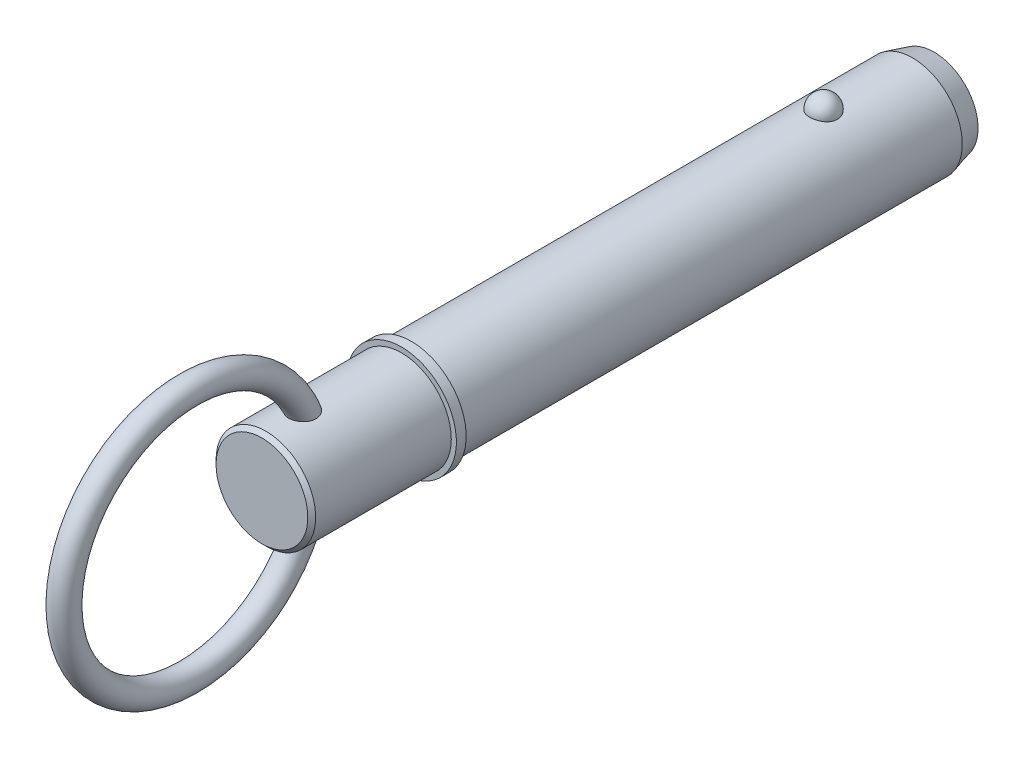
ISO-10303-21;
HEADER;
FILE_DESCRIPTION(('STEP AP214'),'2;1');
FILE_NAME('part.step','',(''),(''),'','','');
FILE_SCHEMA(('AUTOMOTIVE_DESIGN { 1 0 10303 214 1 1 1 1 }'));
ENDSEC;
DATA;
#1=APPLICATION_CONTEXT('core data for automotive mechanical design processes');
#2=APPLICATION_PROTOCOL_DEFINITION('international standard','automotive_design',2000,#1);
#3=PRODUCT_CONTEXT('',#1,'mechanical');
#4=PRODUCT('Part','Part','',(#3));
#5=PRODUCT_RELATED_PRODUCT_CATEGORY('part','',(#4));
#6=PRODUCT_DEFINITION_FORMATION('','',#4);
#7=PRODUCT_DEFINITION_CONTEXT('part definition',#1,'design');
#8=PRODUCT_DEFINITION('design','',#6,#7);
#9=PRODUCT_DEFINITION_SHAPE('','',#8);
#10=(LENGTH_UNIT() NAMED_UNIT(*) SI_UNIT(.MILLI.,.METRE.));
#11=(NAMED_UNIT(*) PLANE_ANGLE_UNIT() SI_UNIT($,.RADIAN.));
#12=(NAMED_UNIT(*) SI_UNIT($,.STERADIAN.) SOLID_ANGLE_UNIT());
#13=UNCERTAINTY_MEASURE_WITH_UNIT(LENGTH_MEASURE(1.E-05),#10,'distance_accuracy_value','');
#14=(GEOMETRIC_REPRESENTATION_CONTEXT(3) GLOBAL_UNCERTAINTY_ASSIGNED_CONTEXT((#13)) GLOBAL_UNIT_ASSIGNED_CONTEXT((#10,
#11,#12)) REPRESENTATION_CONTEXT('',''));
#15=CARTESIAN_POINT('',(0.,0.,0.));
#16=DIRECTION('',(0.,0.,1.));
#17=DIRECTION('',(1.,0.,0.));
#18=AXIS2_PLACEMENT_3D('',#15,#16,#17);
#19=CARTESIAN_POINT('',(0.,0.,101.6));
#20=DIRECTION('',(0.,0.,-1.));
#21=DIRECTION('',(-1.,0.,0.));
#22=AXIS2_PLACEMENT_3D('',#19,#20,#21);
#23=CYLINDRICAL_SURFACE('',#22,12.7);
#24=CARTESIAN_POINT('',(3.52486003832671,12.2010393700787,-3.56));
#25=CARTESIAN_POINT('',(3.52485671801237,12.2010422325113,-3.3610062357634));
#26=CARTESIAN_POINT('',(3.50863187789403,12.2057632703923,-3.16197042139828));
#27=CARTESIAN_POINT('',(3.4441205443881,12.2241207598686,-2.76953945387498));
#28=CARTESIAN_POINT('',(3.39582213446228,12.2377605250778,-2.57614642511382));
#29=CARTESIAN_POINT('',(3.26839193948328,12.2724057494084,-2.20059799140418));
#30=CARTESIAN_POINT('',(3.18927369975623,12.2934079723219,-2.01843769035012));
#31=CARTESIAN_POINT('',(3.00217139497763,12.3404306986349,-1.6703228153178));
#32=CARTESIAN_POINT('',(2.89418796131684,12.3664510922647,-1.50436788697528));
#33=CARTESIAN_POINT('',(2.65144862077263,12.4207616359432,-1.19241975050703));
#34=CARTESIAN_POINT('',(2.51656310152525,12.4490623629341,-1.04652919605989));
#35=CARTESIAN_POINT('',(2.22383249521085,12.5046678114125,-0.779711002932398));
#36=CARTESIAN_POINT('',(2.0659873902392,12.5319725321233,-0.658783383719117));
#37=CARTESIAN_POINT('',(1.73204520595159,12.5824645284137,-0.445586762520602));
#38=CARTESIAN_POINT('',(1.55600183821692,12.6056634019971,-0.353236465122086));
#39=CARTESIAN_POINT('',(1.19021695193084,12.6454411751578,-0.199381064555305));
#40=CARTESIAN_POINT('',(1.00047694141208,12.6620208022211,-0.137872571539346));
#41=CARTESIAN_POINT('',(0.616329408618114,12.6864692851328,-0.0483191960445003));
#42=CARTESIAN_POINT('',(0.422067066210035,12.6944893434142,-0.0196927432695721));
#43=CARTESIAN_POINT('',(0.0313259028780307,12.7014637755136,0.00524116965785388));
#44=CARTESIAN_POINT('',(-0.165152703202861,12.7004190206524,0.00155173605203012));
#45=CARTESIAN_POINT('',(-0.551780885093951,12.6894611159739,-0.0377454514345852));
#46=CARTESIAN_POINT('',(-0.74198078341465,12.6796749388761,-0.0728962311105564));
#47=CARTESIAN_POINT('',(-1.11361063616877,12.6524544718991,-0.173489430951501));
#48=CARTESIAN_POINT('',(-1.29504043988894,12.6350200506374,-0.238932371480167));
#49=CARTESIAN_POINT('',(-1.64521311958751,12.5942270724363,-0.398772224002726));
#50=CARTESIAN_POINT('',(-1.81387645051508,12.5708347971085,-0.493334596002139));
#51=CARTESIAN_POINT('',(-2.13292959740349,12.5206522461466,-0.708731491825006));
#52=CARTESIAN_POINT('',(-2.28331755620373,12.4938616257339,-0.829568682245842));
#53=CARTESIAN_POINT('',(-2.56470285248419,12.4391828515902,-1.0968714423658));
#54=CARTESIAN_POINT('',(-2.69527522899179,12.4112835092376,-1.24378221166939));
#55=CARTESIAN_POINT('',(-2.93023079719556,12.3579248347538,-1.55763192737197));
#56=CARTESIAN_POINT('',(-3.03461212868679,12.3324656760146,-1.72457229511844));
#57=CARTESIAN_POINT('',(-3.21564423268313,12.2865167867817,-2.07598316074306));
#58=CARTESIAN_POINT('',(-3.29196222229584,12.2660875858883,-2.26063321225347));
#59=CARTESIAN_POINT('',(-3.41323771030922,12.2328979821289,-2.64061334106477));
#60=CARTESIAN_POINT('',(-3.45819611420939,12.2201373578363,-2.83594310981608));
#61=CARTESIAN_POINT('',(-3.51550038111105,12.2037762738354,-3.2308649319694));
#62=CARTESIAN_POINT('',(-3.5279827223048,12.200137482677,-3.43043558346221));
#63=CARTESIAN_POINT('',(-3.52041430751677,12.2023234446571,-3.8289025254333));
#64=CARTESIAN_POINT('',(-3.50036443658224,12.2081479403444,-4.02779883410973));
#65=CARTESIAN_POINT('',(-3.42842010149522,12.2285446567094,-4.41824213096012));
#66=CARTESIAN_POINT('',(-3.37668525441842,12.243073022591,-4.6098208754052));
#67=CARTESIAN_POINT('',(-3.24279085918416,12.2792134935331,-4.98132360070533));
#68=CARTESIAN_POINT('',(-3.16063009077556,12.300825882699,-5.16124711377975));
#69=CARTESIAN_POINT('',(-2.96738224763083,12.3488691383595,-5.50542856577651));
#70=CARTESIAN_POINT('',(-2.85613997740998,12.3753256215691,-5.66959579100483));
#71=CARTESIAN_POINT('',(-2.60773241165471,12.4300386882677,-5.97665065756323));
#72=CARTESIAN_POINT('',(-2.47056612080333,12.458295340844,-6.11953748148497));
#73=CARTESIAN_POINT('',(-2.17327999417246,12.5135827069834,-6.38059312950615));
#74=CARTESIAN_POINT('',(-2.01307652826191,12.5406084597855,-6.49866785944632));
#75=CARTESIAN_POINT('',(-1.67442544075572,12.5902954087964,-6.70609314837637));
#76=CARTESIAN_POINT('',(-1.49597909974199,12.6129569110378,-6.79544572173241));
#77=CARTESIAN_POINT('',(-1.12819666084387,12.6511224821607,-6.94192787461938));
#78=CARTESIAN_POINT('',(-0.93902400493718,12.666712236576,-6.99944518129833));
#79=CARTESIAN_POINT('',(-0.553267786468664,12.6894125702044,-7.08227444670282));
#80=CARTESIAN_POINT('',(-0.356685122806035,12.6965241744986,-7.10759029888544));
#81=CARTESIAN_POINT('',(0.0343320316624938,12.7014305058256,-7.12510946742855));
#82=CARTESIAN_POINT('',(0.228736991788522,12.6993986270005,-7.11792901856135));
#83=CARTESIAN_POINT('',(0.613493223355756,12.6866339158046,-7.07206766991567));
#84=CARTESIAN_POINT('',(0.803844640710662,12.6759013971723,-7.03338790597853));
#85=CARTESIAN_POINT('',(1.17440741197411,12.6469443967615,-6.925834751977));
#86=CARTESIAN_POINT('',(1.35465462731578,12.6287486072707,-6.85707692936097));
#87=CARTESIAN_POINT('',(1.70092526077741,12.5867908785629,-6.69128257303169));
#88=CARTESIAN_POINT('',(1.86694777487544,12.5630285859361,-6.59424424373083));
#89=CARTESIAN_POINT('',(2.18289085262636,12.5120350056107,-6.3727748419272));
#90=CARTESIAN_POINT('',(2.33252391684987,12.4847559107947,-6.24794475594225));
#91=CARTESIAN_POINT('',(2.60889724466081,12.4299457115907,-5.97511730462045));
#92=CARTESIAN_POINT('',(2.73563353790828,12.4024145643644,-5.82711592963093));
#93=CARTESIAN_POINT('',(2.96505559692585,12.3495984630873,-5.5091226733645));
#94=CARTESIAN_POINT('',(3.06728335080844,12.3243610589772,-5.33879227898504));
#95=CARTESIAN_POINT('',(3.24218794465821,12.2795120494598,-4.98295005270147));
#96=CARTESIAN_POINT('',(3.31487538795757,12.2598984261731,-4.79744369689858));
#97=CARTESIAN_POINT('',(3.42255689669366,12.2302435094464,-4.43775244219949));
#98=CARTESIAN_POINT('',(3.46085292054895,12.2193780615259,-4.264615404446));
#99=CARTESIAN_POINT('',(3.5120056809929,12.2047747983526,-3.9143299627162));
#100=CARTESIAN_POINT('',(3.52486299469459,12.2010368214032,-3.73718164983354));
#101=CARTESIAN_POINT('',(3.52486003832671,12.2010393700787,-3.56));
#102=B_SPLINE_CURVE_WITH_KNOTS('',3,(#24,#25,#26,#27,#28,#29,#30,#31,#32,#33,#34,#35,#36,#37,
#38,#39,#40,#41,#42,#43,#44,#45,#46,#47,#48,#49,#50,#51,#52,#53,#54,#55,#56,#57,#58,#59,#60,#61,
#62,#63,#64,#65,#66,#67,#68,#69,#70,#71,#72,#73,#74,#75,#76,#77,#78,#79,#80,#81,#82,#83,#84,#85,
#86,#87,#88,#89,#90,#91,#92,#93,#94,#95,#96,#97,#98,#99,#100,#101),.UNSPECIFIED.,.T.,.F.,(4,2,2,
2,2,2,2,2,2,2,2,2,2,2,2,2,2,2,2,2,2,2,2,2,2,2,2,2,2,2,2,2,2,2,2,2,2,2,4),(0.,0.596344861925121,
1.19291141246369,1.78921606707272,2.38550767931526,2.98474477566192,3.58398233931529,
4.18149920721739,4.77895038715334,5.36566361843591,5.95232045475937,6.53059198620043,
7.10887345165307,7.6905033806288,8.27219236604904,8.86498552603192,9.45782077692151,
10.0574751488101,10.6571122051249,11.2542252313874,11.8513220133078,12.4454353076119,
13.0395724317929,13.636947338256,14.2343451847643,14.8339691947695,15.4335511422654,
16.0256602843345,16.6176978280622,17.1985559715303,17.7793931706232,18.3580179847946,
18.9366795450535,19.5242567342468,20.1119357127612,20.7098642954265,21.3075780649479,
21.8385683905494,22.3695466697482),.UNSPECIFIED.);
#103=CARTESIAN_POINT('',(3.52486003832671,12.2010393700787,-3.56));
#104=VERTEX_POINT('',#103);
#105=EDGE_CURVE('E101',#104,#104,#102,.T.);
#106=ORIENTED_EDGE('',*,*,#105,.T.);
#107=EDGE_LOOP('',(#106));
#108=FACE_BOUND('',#107,.T.);
#109=CARTESIAN_POINT('',(0.,0.,-26.2499999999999));
#110=DIRECTION('',(0.,0.,-1.));
#111=DIRECTION('',(-1.,0.,0.));
#112=AXIS2_PLACEMENT_3D('',#109,#110,#111);
#113=CIRCLE('',#112,12.7);
#114=CARTESIAN_POINT('',(-12.7,0.,-26.2499999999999));
#115=VERTEX_POINT('',#114);
#116=EDGE_CURVE('E109',#115,#115,#113,.F.);
#117=ORIENTED_EDGE('',*,*,#116,.T.);
#118=EDGE_LOOP('',(#117));
#119=FACE_BOUND('',#118,.T.);
#120=CARTESIAN_POINT('',(0.,0.,101.6));
#121=DIRECTION('',(0.,0.,1.));
#122=DIRECTION('',(1.,0.,0.));
#123=AXIS2_PLACEMENT_3D('',#120,#121,#122);
#124=CIRCLE('',#123,12.7);
#125=CARTESIAN_POINT('',(12.7,0.,101.6));
#126=VERTEX_POINT('',#125);
#127=EDGE_CURVE('E107',#126,#126,#124,.T.);
#128=ORIENTED_EDGE('',*,*,#127,.F.);
#129=EDGE_LOOP('',(#128));
#130=FACE_BOUND('',#129,.T.);
#131=ADVANCED_FACE('F39',(#108,#119,#130),#23,.T.);
#132=CARTESIAN_POINT('',(0.,0.,-31.75));
#133=DIRECTION('',(0.,0.,-1.));
#134=DIRECTION('',(-1.,0.,0.));
#135=AXIS2_PLACEMENT_3D('',#132,#133,#134);
#136=PLANE('',#135);
#137=CARTESIAN_POINT('',(0.,0.,-31.75));
#138=DIRECTION('',(0.,0.,-1.));
#139=DIRECTION('',(-1.,0.,0.));
#140=AXIS2_PLACEMENT_3D('',#137,#138,#139);
#141=CIRCLE('',#140,11.2262794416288);
#142=CARTESIAN_POINT('',(-11.2262794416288,0.,-31.75));
#143=VERTEX_POINT('',#142);
#144=EDGE_CURVE('E141',#143,#143,#141,.T.);
#145=ORIENTED_EDGE('',*,*,#144,.T.);
#146=EDGE_LOOP('',(#145));
#147=FACE_BOUND('',#146,.T.);
#148=ADVANCED_FACE('F87',(#147),#136,.T.);
#149=CARTESIAN_POINT('',(0.,0.,-31.75));
#150=DIRECTION('',(0.,0.,1.));
#151=DIRECTION('',(1.,0.,0.));
#152=AXIS2_PLACEMENT_3D('',#149,#150,#151);
#153=CONICAL_SURFACE('',#152,11.2262794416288,0.261799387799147);
#154=ORIENTED_EDGE('',*,*,#116,.F.);
#155=EDGE_LOOP('',(#154));
#156=FACE_BOUND('',#155,.T.);
#157=ORIENTED_EDGE('',*,*,#144,.F.);
#158=EDGE_LOOP('',(#157));
#159=FACE_BOUND('',#158,.T.);
#160=ADVANCED_FACE('F93',(#156,#159),#153,.T.);
#161=CARTESIAN_POINT('',(0.,12.7,-3.56));
#162=DIRECTION('',(0.,1.,0.));
#163=DIRECTION('',(0.,0.,1.));
#164=AXIS2_PLACEMENT_3D('',#161,#162,#163);
#165=SPHERICAL_SURFACE('',#164,3.56);
#166=ORIENTED_EDGE('',*,*,#105,.F.);
#167=EDGE_LOOP('',(#166));
#168=FACE_BOUND('',#167,.T.);
#169=ADVANCED_FACE('F112',(#168),#165,.T.);
#170=CARTESIAN_POINT('',(0.,0.,101.6));
#171=DIRECTION('',(0.,0.,-1.));
#172=DIRECTION('',(-1.,0.,0.));
#173=AXIS2_PLACEMENT_3D('',#170,#171,#172);
#174=PLANE('',#173);
#175=ORIENTED_EDGE('',*,*,#127,.T.);
#176=EDGE_LOOP('',(#175));
#177=FACE_BOUND('',#176,.T.);
#178=CARTESIAN_POINT('',(0.,0.,101.6));
#179=DIRECTION('',(0.,0.,-1.));
#180=DIRECTION('',(-1.,0.,0.));
#181=AXIS2_PLACEMENT_3D('',#178,#179,#180);
#182=CIRCLE('',#181,14.);
#183=CARTESIAN_POINT('',(-14.,0.,101.6));
#184=VERTEX_POINT('',#183);
#185=EDGE_CURVE('E108',#184,#184,#182,.T.);
#186=ORIENTED_EDGE('',*,*,#185,.T.);
#187=EDGE_LOOP('',(#186));
#188=FACE_BOUND('',#187,.T.);
#189=ADVANCED_FACE('F116',(#177,#188),#174,.T.);
#190=CARTESIAN_POINT('',(0.,0.,33.7287874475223));
#191=DIRECTION('',(0.,0.,-1.));
#192=DIRECTION('',(-1.,0.,0.));
#193=AXIS2_PLACEMENT_3D('',#190,#191,#192);
#194=CYLINDRICAL_SURFACE('',#193,14.);
#195=CARTESIAN_POINT('',(0.,0.,104.1));
#196=DIRECTION('',(0.,0.,-1.));
#197=DIRECTION('',(-1.,0.,0.));
#198=AXIS2_PLACEMENT_3D('',#195,#196,#197);
#199=CIRCLE('',#198,14.);
#200=CARTESIAN_POINT('',(-14.,0.,104.1));
#201=VERTEX_POINT('',#200);
#202=EDGE_CURVE('E133',#201,#201,#199,.T.);
#203=ORIENTED_EDGE('',*,*,#202,.T.);
#204=EDGE_LOOP('',(#203));
#205=FACE_BOUND('',#204,.T.);
#206=ORIENTED_EDGE('',*,*,#185,.F.);
#207=EDGE_LOOP('',(#206));
#208=FACE_BOUND('',#207,.T.);
#209=ADVANCED_FACE('F120',(#205,#208),#194,.T.);
#210=CARTESIAN_POINT('',(0.,14.,104.1));
#211=DIRECTION('',(0.,0.,1.));
#212=DIRECTION('',(1.,0.,0.));
#213=AXIS2_PLACEMENT_3D('',#210,#211,#212);
#214=PLANE('',#213);
#215=CARTESIAN_POINT('',(0.,0.,104.1));
#216=DIRECTION('',(0.,0.,1.));
#217=DIRECTION('',(1.,0.,0.));
#218=AXIS2_PLACEMENT_3D('',#215,#216,#217);
#219=CIRCLE('',#218,12.7);
#220=CARTESIAN_POINT('',(12.7,0.,104.1));
#221=VERTEX_POINT('',#220);
#222=EDGE_CURVE('E111',#221,#221,#219,.T.);
#223=ORIENTED_EDGE('',*,*,#222,.F.);
#224=EDGE_LOOP('',(#223));
#225=FACE_BOUND('',#224,.T.);
#226=ORIENTED_EDGE('',*,*,#202,.F.);
#227=EDGE_LOOP('',(#226));
#228=FACE_BOUND('',#227,.T.);
#229=ADVANCED_FACE('F84',(#225,#228),#214,.T.);
#230=CARTESIAN_POINT('',(0.,0.,139.7));
#231=DIRECTION('',(0.,0.,-1.));
#232=DIRECTION('',(-1.,0.,0.));
#233=AXIS2_PLACEMENT_3D('',#230,#231,#232);
#234=CYLINDRICAL_SURFACE('',#233,12.7);
#235=CARTESIAN_POINT('',(-1.22892607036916,-12.6404011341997,126.07119395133));
#236=CARTESIAN_POINT('',(-1.06119922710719,-12.6567092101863,126.004004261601));
#237=CARTESIAN_POINT('',(-0.887663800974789,-12.6701810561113,125.950792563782));
#238=CARTESIAN_POINT('',(-0.533823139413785,-12.6900116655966,125.873419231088));
#239=CARTESIAN_POINT('',(-0.353518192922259,-12.6963707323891,125.8492563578));
#240=CARTESIAN_POINT('',(0.00871153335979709,-12.7012887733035,125.830519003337));
#241=CARTESIAN_POINT('',(0.190636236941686,-12.699848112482,125.835943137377));
#242=CARTESIAN_POINT('',(0.550971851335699,-12.6893231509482,125.876255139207));
#243=CARTESIAN_POINT('',(0.729382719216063,-12.6802387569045,125.91114336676));
#244=CARTESIAN_POINT('',(1.0777168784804,-12.6553960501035,126.009659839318));
#245=CARTESIAN_POINT('',(1.24763507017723,-12.6396337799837,126.073305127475));
#246=CARTESIAN_POINT('',(1.57398922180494,-12.6031560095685,126.227891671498));
#247=CARTESIAN_POINT('',(1.73042571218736,-12.5824407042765,126.318831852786));
#248=CARTESIAN_POINT('',(2.02464767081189,-12.5384554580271,126.525320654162));
#249=CARTESIAN_POINT('',(2.16251370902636,-12.5151974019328,126.64075697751));
#250=CARTESIAN_POINT('',(2.41652917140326,-12.4686447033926,126.893426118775));
#251=CARTESIAN_POINT('',(2.53268123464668,-12.4453500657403,127.030656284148));
#252=CARTESIAN_POINT('',(2.7397169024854,-12.4014166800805,127.32226178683));
#253=CARTESIAN_POINT('',(2.83072997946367,-12.3807646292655,127.476543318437));
#254=CARTESIAN_POINT('',(2.98642630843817,-12.3441356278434,127.798338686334));
#255=CARTESIAN_POINT('',(3.05110876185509,-12.3281588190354,127.965852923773));
#256=CARTESIAN_POINT('',(3.15450336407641,-12.3021148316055,128.312705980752));
#257=CARTESIAN_POINT('',(3.19268116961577,-12.2921697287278,128.492212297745));
#258=CARTESIAN_POINT('',(3.24150148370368,-12.2793848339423,128.855144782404));
#259=CARTESIAN_POINT('',(3.25213515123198,-12.2765473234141,129.038572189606));
#260=CARTESIAN_POINT('',(3.24696781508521,-12.2779158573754,129.418893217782));
#261=CARTESIAN_POINT('',(3.22910261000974,-12.2826719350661,129.615753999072));
#262=CARTESIAN_POINT('',(3.1650495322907,-12.2993299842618,130.00447917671));
#263=CARTESIAN_POINT('',(3.11884966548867,-12.3112349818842,130.196341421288));
#264=CARTESIAN_POINT('',(2.99323123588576,-12.3424162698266,130.592891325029));
#265=CARTESIAN_POINT('',(2.91059577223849,-12.3623844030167,130.796505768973));
#266=CARTESIAN_POINT('',(2.71447440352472,-12.4069229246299,131.188190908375));
#267=CARTESIAN_POINT('',(2.60094970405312,-12.431499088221,131.376241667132));
#268=CARTESIAN_POINT('',(2.40499526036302,-12.4703951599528,131.647470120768));
#269=CARTESIAN_POINT('',(2.33301847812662,-12.4841083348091,131.738407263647));
#270=CARTESIAN_POINT('',(2.18106597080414,-12.5115521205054,131.913320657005));
#271=CARTESIAN_POINT('',(2.10108885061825,-12.5252827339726,131.997295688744));
#272=CARTESIAN_POINT('',(1.84973962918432,-12.5657115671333,132.236779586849));
#273=CARTESIAN_POINT('',(1.66646770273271,-12.5917488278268,132.380526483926));
#274=CARTESIAN_POINT('',(1.33551340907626,-12.6303067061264,132.585856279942));
#275=CARTESIAN_POINT('',(1.19512135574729,-12.6444898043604,132.65902243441));
#276=CARTESIAN_POINT('',(0.903945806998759,-12.6686276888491,132.781586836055));
#277=CARTESIAN_POINT('',(0.753173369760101,-12.6785868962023,132.831009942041));
#278=CARTESIAN_POINT('',(0.444090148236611,-12.6931800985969,132.902942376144));
#279=CARTESIAN_POINT('',(0.285741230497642,-12.6977833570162,132.925296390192));
#280=CARTESIAN_POINT('',(-0.0324491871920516,-12.700953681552,132.940724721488));
#281=CARTESIAN_POINT('',(-0.192290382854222,-12.6995219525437,132.933804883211));
#282=CARTESIAN_POINT('',(-0.493822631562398,-12.6912132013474,132.893209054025));
#283=CARTESIAN_POINT('',(-0.635865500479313,-12.6848307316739,132.861962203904));
#284=CARTESIAN_POINT('',(-0.913041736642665,-12.6678986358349,132.777721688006));
#285=CARTESIAN_POINT('',(-1.04817349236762,-12.6573480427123,132.724722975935));
#286=CARTESIAN_POINT('',(-1.31637898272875,-12.6323524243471,132.596233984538));
#287=CARTESIAN_POINT('',(-1.44890088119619,-12.6177203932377,132.519638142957));
#288=CARTESIAN_POINT('',(-1.70162176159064,-12.5861326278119,132.348743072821));
#289=CARTESIAN_POINT('',(-1.82181486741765,-12.569175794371,132.254435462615));
#290=CARTESIAN_POINT('',(-2.06961284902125,-12.5309682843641,132.032665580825));
#291=CARTESIAN_POINT('',(-2.1945762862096,-12.5094982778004,131.90229330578));
#292=CARTESIAN_POINT('',(-2.4250376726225,-12.4668738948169,131.625308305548));
#293=CARTESIAN_POINT('',(-2.53052086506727,-12.4457197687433,131.478683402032));
#294=CARTESIAN_POINT('',(-2.73961150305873,-12.4015349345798,131.143065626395));
#295=CARTESIAN_POINT('',(-2.83895917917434,-12.3789253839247,130.951346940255));
#296=CARTESIAN_POINT('',(-3.00725804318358,-12.3391195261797,130.554405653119));
#297=CARTESIAN_POINT('',(-3.07618857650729,-12.3219268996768,130.349173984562));
#298=CARTESIAN_POINT('',(-3.18528660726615,-12.2942052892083,129.913754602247));
#299=CARTESIAN_POINT('',(-3.22287145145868,-12.2842816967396,129.682855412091));
#300=CARTESIAN_POINT('',(-3.24821271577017,-12.2775854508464,129.334351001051));
#301=CARTESIAN_POINT('',(-3.25148236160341,-12.276719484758,129.217777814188));
#302=CARTESIAN_POINT('',(-3.24729041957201,-12.2778310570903,128.984859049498));
#303=CARTESIAN_POINT('',(-3.23983534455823,-12.2798068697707,128.868513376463));
#304=CARTESIAN_POINT('',(-3.21488959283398,-12.286359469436,128.64622762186));
#305=CARTESIAN_POINT('',(-3.19823165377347,-12.2907201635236,128.540186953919));
#306=CARTESIAN_POINT('',(-3.15537465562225,-12.3017926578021,128.33022257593));
#307=CARTESIAN_POINT('',(-3.12918076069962,-12.3085031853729,128.226297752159));
#308=CARTESIAN_POINT('',(-3.06721568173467,-12.3240904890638,128.021553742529));
#309=CARTESIAN_POINT('',(-3.03144854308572,-12.3329663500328,127.920733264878));
#310=CARTESIAN_POINT('',(-2.95042598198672,-12.3525998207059,127.723171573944));
#311=CARTESIAN_POINT('',(-2.90517160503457,-12.3633572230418,127.626429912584));
#312=CARTESIAN_POINT('',(-2.81116315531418,-12.3850478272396,127.448857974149));
#313=CARTESIAN_POINT('',(-2.76340897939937,-12.3958187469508,127.367476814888));
#314=CARTESIAN_POINT('',(-2.66091958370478,-12.4182228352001,127.209317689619));
#315=CARTESIAN_POINT('',(-2.60618212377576,-12.4298562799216,127.132541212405));
#316=CARTESIAN_POINT('',(-2.49013138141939,-12.4536239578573,126.984278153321));
#317=CARTESIAN_POINT('',(-2.42882150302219,-12.4657579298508,126.912788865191));
#318=CARTESIAN_POINT('',(-2.30002146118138,-12.4901640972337,126.775587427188));
#319=CARTESIAN_POINT('',(-2.23252894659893,-12.5024363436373,126.709877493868));
#320=CARTESIAN_POINT('',(-2.09370795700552,-12.5264205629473,126.586377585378));
#321=CARTESIAN_POINT('',(-2.02252382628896,-12.5381388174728,126.528426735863));
#322=CARTESIAN_POINT('',(-1.87531735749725,-12.5610012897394,126.41889123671));
#323=CARTESIAN_POINT('',(-1.79929316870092,-12.5721452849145,126.367309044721));
#324=CARTESIAN_POINT('',(-1.56485282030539,-12.6042047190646,126.222706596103));
#325=CARTESIAN_POINT('',(-1.39990754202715,-12.6237766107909,126.139687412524));
#326=CARTESIAN_POINT('',(-1.22892607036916,-12.6404011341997,126.07119395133));
#327=B_SPLINE_CURVE_WITH_KNOTS('',3,(#235,#236,#237,#238,#239,#240,#241,#242,#243,#244,#245,
#246,#247,#248,#249,#250,#251,#252,#253,#254,#255,#256,#257,#258,#259,#260,#261,#262,#263,#264,
#265,#266,#267,#268,#269,#270,#271,#272,#273,#274,#275,#276,#277,#278,#279,#280,#281,#282,#283,
#284,#285,#286,#287,#288,#289,#290,#291,#292,#293,#294,#295,#296,#297,#298,#299,#300,#301,#302,
#303,#304,#305,#306,#307,#308,#309,#310,#311,#312,#313,#314,#315,#316,#317,#318,#319,#320,#321,
#322,#323,#324,#325,#326),.UNSPECIFIED.,.T.,.F.,(4,2,2,2,2,2,2,2,2,2,2,2,2,2,2,2,2,2,2,2,2,2,2,
2,2,2,2,2,2,2,2,2,2,2,2,2,2,2,2,2,2,2,2,2,2,4),(0.,0.543509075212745,1.08699497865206,
1.63045544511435,2.17392254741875,2.71771216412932,3.26148037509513,3.80280767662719,
4.34406914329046,4.88248866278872,5.42092451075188,5.9699227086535,6.51909710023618,
7.10988630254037,7.70092576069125,8.36013748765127,9.02018098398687,9.37009147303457,
9.72006308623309,10.4175255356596,10.8925536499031,11.3670833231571,11.844322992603,
12.3214673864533,12.7562647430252,13.1911630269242,13.6507378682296,14.110530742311,
14.6541210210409,15.1981214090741,15.8467121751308,16.4957426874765,17.1940750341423,
17.5435132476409,17.8927393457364,18.2145822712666,18.536251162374,18.8577843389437,
19.1792821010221,19.4638320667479,19.7484735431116,20.0329683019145,20.3175717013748,
20.5948148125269,20.8721645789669,21.4262200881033),.UNSPECIFIED.);
#328=CARTESIAN_POINT('',(-1.22892607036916,-12.6404011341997,126.07119395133));
#329=VERTEX_POINT('',#328);
#330=EDGE_CURVE('E10',#329,#329,#327,.T.);
#331=ORIENTED_EDGE('',*,*,#330,.F.);
#332=EDGE_LOOP('',(#331));
#333=FACE_BOUND('',#332,.T.);
#334=CARTESIAN_POINT('',(-1.22892607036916,12.6404011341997,126.07119395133));
#335=CARTESIAN_POINT('',(-1.39512541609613,12.624240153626,126.13776712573));
#336=CARTESIAN_POINT('',(-1.55582432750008,12.6052778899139,126.218153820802));
#337=CARTESIAN_POINT('',(-1.86136954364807,12.5638060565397,126.404658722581));
#338=CARTESIAN_POINT('',(-2.00617769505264,12.5412882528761,126.510836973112));
#339=CARTESIAN_POINT('',(-2.27547906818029,12.4952333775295,126.746103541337));
#340=CARTESIAN_POINT('',(-2.3999874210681,12.4716970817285,126.875174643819));
#341=CARTESIAN_POINT('',(-2.62534229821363,12.4262157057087,127.152623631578));
#342=CARTESIAN_POINT('',(-2.72620384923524,12.4042696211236,127.300989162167));
#343=CARTESIAN_POINT('',(-2.90197976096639,12.3643304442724,127.6126750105));
#344=CARTESIAN_POINT('',(-2.97691335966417,12.346334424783,127.775984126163));
#345=CARTESIAN_POINT('',(-3.09983588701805,12.3160482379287,128.112927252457));
#346=CARTESIAN_POINT('',(-3.14781852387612,12.3037594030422,128.286563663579));
#347=CARTESIAN_POINT('',(-3.21809353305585,12.2855709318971,128.645523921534));
#348=CARTESIAN_POINT('',(-3.23943500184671,12.2799082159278,128.831044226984));
#349=CARTESIAN_POINT('',(-3.2544382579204,12.2759385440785,129.203232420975));
#350=CARTESIAN_POINT('',(-3.24809142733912,12.2776338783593,129.389900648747));
#351=CARTESIAN_POINT('',(-3.20755159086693,12.288291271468,129.777577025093));
#352=CARTESIAN_POINT('',(-3.17081691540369,12.2979162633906,129.978299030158));
#353=CARTESIAN_POINT('',(-3.06845850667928,12.3238513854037,130.371858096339));
#354=CARTESIAN_POINT('',(-3.00281105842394,12.3401670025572,130.564688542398));
#355=CARTESIAN_POINT('',(-2.83560995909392,12.3797223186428,130.959473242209));
#356=CARTESIAN_POINT('',(-2.73085133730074,12.4035339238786,131.160019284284));
#357=CARTESIAN_POINT('',(-2.48976141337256,12.4541651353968,131.540813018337));
#358=CARTESIAN_POINT('',(-2.35343772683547,12.4809840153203,131.721065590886));
#359=CARTESIAN_POINT('',(-2.07683984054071,12.5296806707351,132.02565995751));
#360=CARTESIAN_POINT('',(-1.94129351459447,12.551613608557,132.154283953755));
#361=CARTESIAN_POINT('',(-1.65081707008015,12.5931023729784,132.387836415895));
#362=CARTESIAN_POINT('',(-1.49591505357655,12.6126615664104,132.492798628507));
#363=CARTESIAN_POINT('',(-1.19690065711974,12.6442092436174,132.657788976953));
#364=CARTESIAN_POINT('',(-1.0554126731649,12.6569190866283,132.722418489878));
#365=CARTESIAN_POINT('',(-0.76341583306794,12.6778764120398,132.827638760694));
#366=CARTESIAN_POINT('',(-0.612913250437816,12.6861269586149,132.868246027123));
#367=CARTESIAN_POINT('',(-0.306168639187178,12.697239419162,132.922715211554));
#368=CARTESIAN_POINT('',(-0.149903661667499,12.7000767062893,132.936454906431));
#369=CARTESIAN_POINT('',(0.162552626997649,12.699920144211,132.93569423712));
#370=CARTESIAN_POINT('',(0.318743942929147,12.6969267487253,132.921196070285));
#371=CARTESIAN_POINT('',(0.614555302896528,12.6859231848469,132.867234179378));
#372=CARTESIAN_POINT('',(0.754548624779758,12.6782987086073,132.829687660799));
#373=CARTESIAN_POINT('',(1.0268504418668,12.6591561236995,132.733711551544));
#374=CARTESIAN_POINT('',(1.15915690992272,12.6476369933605,132.675276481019));
#375=CARTESIAN_POINT('',(1.42405861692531,12.6206654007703,132.534988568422));
#376=CARTESIAN_POINT('',(1.5558287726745,12.604971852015,132.451635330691));
#377=CARTESIAN_POINT('',(1.80621935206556,12.571537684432,132.267498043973));
#378=CARTESIAN_POINT('',(1.92483289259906,12.5537960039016,132.166704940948));
#379=CARTESIAN_POINT('',(2.16936918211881,12.5140714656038,131.930174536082));
#380=CARTESIAN_POINT('',(2.29236422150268,12.4919255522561,131.791439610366));
#381=CARTESIAN_POINT('',(2.5176248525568,12.4484835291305,131.497913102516));
#382=CARTESIAN_POINT('',(2.61987416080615,12.4271880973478,131.343109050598));
#383=CARTESIAN_POINT('',(2.81956306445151,12.3835520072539,130.991316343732));
#384=CARTESIAN_POINT('',(2.91268031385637,12.3617361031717,130.791798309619));
#385=CARTESIAN_POINT('',(3.06675738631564,12.3244204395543,130.379898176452));
#386=CARTESIAN_POINT('',(3.12769905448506,12.3089242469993,130.167508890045));
#387=CARTESIAN_POINT('',(3.19410612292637,12.2917937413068,129.837729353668));
#388=CARTESIAN_POINT('',(3.21217746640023,12.2870696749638,129.722917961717));
#389=CARTESIAN_POINT('',(3.23822570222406,12.2802317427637,129.492095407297));
#390=CARTESIAN_POINT('',(3.24620727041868,12.2781166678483,129.37608482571));
#391=CARTESIAN_POINT('',(3.25166839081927,12.2766712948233,129.14381042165));
#392=CARTESIAN_POINT('',(3.24914931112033,12.2773406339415,129.027546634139));
#393=CARTESIAN_POINT('',(3.23325304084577,12.2815367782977,128.795869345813));
#394=CARTESIAN_POINT('',(3.21988260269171,12.2850618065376,128.68045536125));
#395=CARTESIAN_POINT('',(3.18378347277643,12.2944635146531,128.462188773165));
#396=CARTESIAN_POINT('',(3.16203615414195,12.3000921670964,128.359162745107));
#397=CARTESIAN_POINT('',(3.10931056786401,12.3135262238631,128.155694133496));
#398=CARTESIAN_POINT('',(3.0783372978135,12.3213304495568,128.05525018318));
#399=CARTESIAN_POINT('',(3.00719503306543,12.3388864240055,127.857882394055));
#400=CARTESIAN_POINT('',(2.96702904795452,12.34863753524,127.760957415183));
#401=CARTESIAN_POINT('',(2.87766260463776,12.3697681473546,127.57155308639));
#402=CARTESIAN_POINT('',(2.82846300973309,12.3811474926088,127.479073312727));
#403=CARTESIAN_POINT('',(2.72718770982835,12.4038233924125,127.309278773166));
#404=CARTESIAN_POINT('',(2.67601025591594,12.4149937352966,127.231409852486));
#405=CARTESIAN_POINT('',(2.56702778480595,12.4379850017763,127.080514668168));
#406=CARTESIAN_POINT('',(2.50922051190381,12.4498061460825,127.007490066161));
#407=CARTESIAN_POINT('',(2.38741431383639,12.4737362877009,126.866915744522));
#408=CARTESIAN_POINT('',(2.32341881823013,12.4858451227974,126.799363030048));
#409=CARTESIAN_POINT('',(2.18967865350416,12.5099935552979,126.670183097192));
#410=CARTESIAN_POINT('',(2.11993188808,12.5220331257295,126.608558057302));
#411=CARTESIAN_POINT('',(1.90863625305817,12.5565453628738,126.437971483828));
#412=CARTESIAN_POINT('',(1.75996750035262,12.5784460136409,126.337508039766));
#413=CARTESIAN_POINT('',(1.44761854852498,12.6182083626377,126.162748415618));
#414=CARTESIAN_POINT('',(1.28394037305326,12.6360706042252,126.088448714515));
#415=CARTESIAN_POINT('',(0.945887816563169,12.6658634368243,125.967537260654));
#416=CARTESIAN_POINT('',(0.771499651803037,12.6777861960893,125.920962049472));
#417=CARTESIAN_POINT('',(0.417041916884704,12.694390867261,125.856673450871));
#418=CARTESIAN_POINT('',(0.236969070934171,12.6990685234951,125.838977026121));
#419=CARTESIAN_POINT('',(-0.124879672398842,12.7006841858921,125.832829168));
#420=CARTESIAN_POINT('',(-0.306658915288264,12.6975703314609,125.844573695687));
#421=CARTESIAN_POINT('',(-0.665297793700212,12.6838264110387,125.897473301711));
#422=CARTESIAN_POINT('',(-0.842168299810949,12.6732146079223,125.938556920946));
#423=CARTESIAN_POINT('',(-1.0502551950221,12.6565519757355,126.005394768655));
#424=CARTESIAN_POINT('',(-1.08632235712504,12.6535053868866,126.017681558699));
#425=CARTESIAN_POINT('',(-1.15798463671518,12.6471484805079,126.043501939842));
#426=CARTESIAN_POINT('',(-1.19357974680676,12.643838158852,126.05703555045));
#427=CARTESIAN_POINT('',(-1.22892607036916,12.6404011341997,126.07119395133));
#428=B_SPLINE_CURVE_WITH_KNOTS('',3,(#334,#335,#336,#337,#338,#339,#340,#341,#342,#343,#344,
#345,#346,#347,#348,#349,#350,#351,#352,#353,#354,#355,#356,#357,#358,#359,#360,#361,#362,#363,
#364,#365,#366,#367,#368,#369,#370,#371,#372,#373,#374,#375,#376,#377,#378,#379,#380,#381,#382,
#383,#384,#385,#386,#387,#388,#389,#390,#391,#392,#393,#394,#395,#396,#397,#398,#399,#400,#401,
#402,#403,#404,#405,#406,#407,#408,#409,#410,#411,#412,#413,#414,#415,#416,#417,#418,#419,#420,
#421,#422,#423,#424,#425,#426,#427),.UNSPECIFIED.,.T.,.F.,(4,2,2,2,2,2,2,2,2,2,2,2,2,2,2,2,2,2,
2,2,2,2,2,2,2,2,2,2,2,2,2,2,2,2,2,2,2,2,2,2,2,2,2,2,2,2,4),(0.,0.539146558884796,
1.07956050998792,1.6195697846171,2.15923496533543,2.69849886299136,3.23788860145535,
3.79602631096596,4.3543377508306,4.96471598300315,5.57559579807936,6.2550948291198,
6.93443009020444,7.4967142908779,8.05819140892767,8.52445959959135,8.99040698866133,
9.45846913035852,9.92649485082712,10.3600530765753,10.7937251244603,11.2621204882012,
11.7307597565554,12.2888675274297,12.8474116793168,13.5084064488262,14.1697737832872,
14.5183408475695,14.8667463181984,15.2151063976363,15.5632498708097,15.8791508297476,
16.1948809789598,16.5105079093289,16.826104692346,17.1072964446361,17.3885841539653,
17.669716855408,17.9509524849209,18.490448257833,19.0298713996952,19.5700039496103,
20.1104536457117,20.6545101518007,21.1972460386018,21.3119068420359,21.4265694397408),.UNSPECIFIED.);
#429=CARTESIAN_POINT('',(-1.22892607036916,12.6404011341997,126.07119395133));
#430=VERTEX_POINT('',#429);
#431=EDGE_CURVE('E51',#430,#430,#428,.T.);
#432=ORIENTED_EDGE('',*,*,#431,.F.);
#433=EDGE_LOOP('',(#432));
#434=FACE_BOUND('',#433,.T.);
#435=CARTESIAN_POINT('',(0.,0.,138.7));
#436=DIRECTION('',(0.,0.,-1.));
#437=DIRECTION('',(-1.,0.,0.));
#438=AXIS2_PLACEMENT_3D('',#435,#436,#437);
#439=CIRCLE('',#438,12.7);
#440=CARTESIAN_POINT('',(-12.7,0.,138.7));
#441=VERTEX_POINT('',#440);
#442=EDGE_CURVE('E63',#441,#441,#439,.T.);
#443=ORIENTED_EDGE('',*,*,#442,.T.);
#444=EDGE_LOOP('',(#443));
#445=FACE_BOUND('',#444,.T.);
#446=ORIENTED_EDGE('',*,*,#222,.T.);
#447=EDGE_LOOP('',(#446));
#448=FACE_BOUND('',#447,.T.);
#449=ADVANCED_FACE('F68',(#333,#434,#445,#448),#234,.T.);
#450=CARTESIAN_POINT('',(0.,0.,139.7));
#451=DIRECTION('',(0.,0.,-1.));
#452=DIRECTION('',(-1.,0.,0.));
#453=AXIS2_PLACEMENT_3D('',#450,#451,#452);
#454=PLANE('',#453);
#455=CARTESIAN_POINT('',(0.,0.,139.7));
#456=DIRECTION('',(0.,0.,-1.));
#457=DIRECTION('',(-1.,0.,0.));
#458=AXIS2_PLACEMENT_3D('',#455,#456,#457);
#459=CIRCLE('',#458,11.6999999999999);
#460=CARTESIAN_POINT('',(-11.6999999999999,0.,139.7));
#461=VERTEX_POINT('',#460);
#462=EDGE_CURVE('E57',#461,#461,#459,.F.);
#463=ORIENTED_EDGE('',*,*,#462,.T.);
#464=EDGE_LOOP('',(#463));
#465=FACE_BOUND('',#464,.T.);
#466=ADVANCED_FACE('F75',(#465),#454,.F.);
#467=CARTESIAN_POINT('',(0.,0.,138.7));
#468=DIRECTION('',(0.,0.,-1.));
#469=DIRECTION('',(-1.,0.,0.));
#470=AXIS2_PLACEMENT_3D('',#467,#468,#469);
#471=CONICAL_SURFACE('',#470,12.7,0.785398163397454);
#472=ORIENTED_EDGE('',*,*,#462,.F.);
#473=EDGE_LOOP('',(#472));
#474=FACE_BOUND('',#473,.T.);
#475=ORIENTED_EDGE('',*,*,#442,.F.);
#476=EDGE_LOOP('',(#475));
#477=FACE_BOUND('',#476,.T.);
#478=ADVANCED_FACE('F41',(#474,#477),#471,.T.);
#479=CARTESIAN_POINT('',(0.,0.,158.45));
#480=DIRECTION('',(1.,0.,0.));
#481=DIRECTION('',(0.,0.,-1.));
#482=AXIS2_PLACEMENT_3D('',#479,#480,#481);
#483=TOROIDAL_SURFACE('',#482,31.75,3.25);
#484=ORIENTED_EDGE('',*,*,#330,.T.);
#485=EDGE_LOOP('',(#484));
#486=FACE_BOUND('',#485,.T.);
#487=ORIENTED_EDGE('',*,*,#431,.T.);
#488=EDGE_LOOP('',(#487));
#489=FACE_BOUND('',#488,.T.);
#490=ADVANCED_FACE('F72',(#486,#489),#483,.T.);
#491=CLOSED_SHELL('',(#131,#148,#160,#169,#189,#209,#229,#449,#466,#478,#490));
#492=MANIFOLD_SOLID_BREP('B2',#491);
#493=ADVANCED_BREP_SHAPE_REPRESENTATION('',(#18,#492),#14);
#494=SHAPE_DEFINITION_REPRESENTATION(#9,#493);
ENDSEC;
END-ISO-10303-21;
